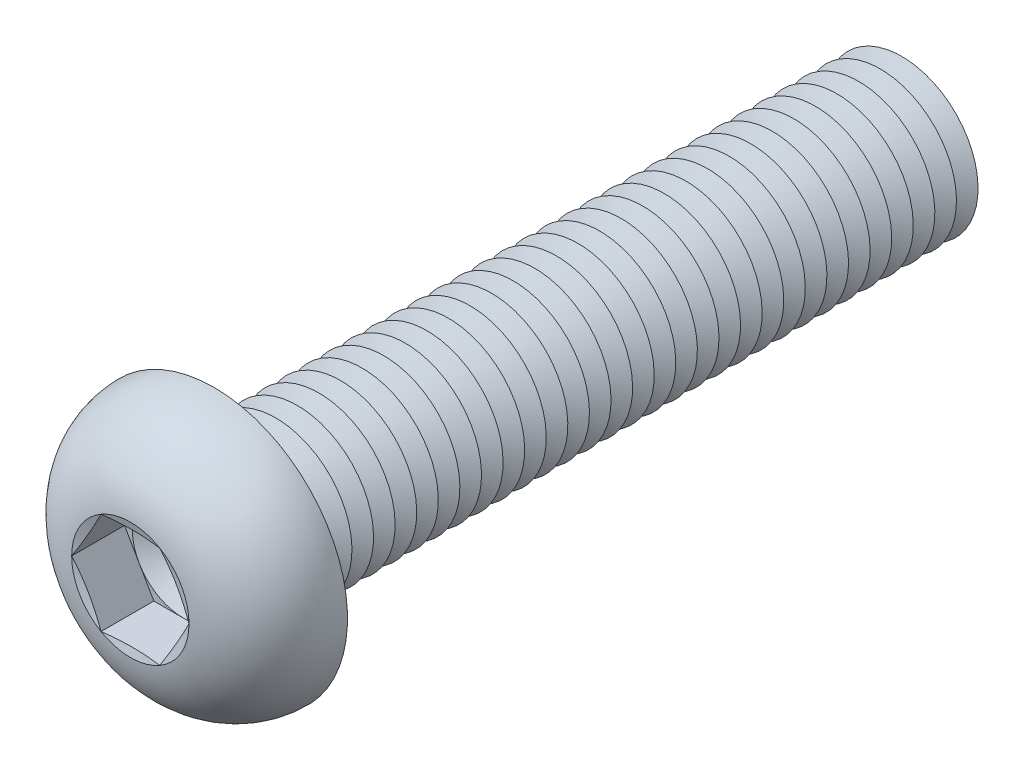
from build123d import *

# Parameters (mm, degrees)
FILLET1_R          = 0.85
LPATTERN1_COUNT    = 32
LPATTERN1_PITCH    = 1.7
CUT_EXTRUDE1_DEPTH = 4.16


with BuildPart() as part:
    # Sketch1 → Revolve1 (revolve)
    with BuildSketch(Plane(origin=(0, 0, 0), x_dir=(0, 0, -1), z_dir=(1, 0, 0))):
        with BuildLine():
            Line((0, 6), (0, 10.5))
            ThreePointArc((0, 10.5), (-4.420082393, 8.816378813), (-6.6, 4.6188))
            Line((-6.6, 4.6188), (-5.981198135, 2.3094))
            Line((-5.981198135, 2.3094), (-6.6, 2.3094))
            Line((-6.6, 2.3094), (-6.6, 0))
            Line((-6.6, 0), (55, 0))
            Line((55, 0), (55, 6))
            Line((55, 6), (0, 6))
        make_face()
    revolve(axis=Axis((0, 0, -55), (0, 0, 1)))

    # Fillet1
    fillet1_edges = [part.edges().sort_by_distance(p)[0] for p in [
        (0, -6, 0),
    ]]
    fillet(fillet1_edges, radius=FILLET1_R)

    # Sketch2 → Cut-Revolve1 (revolve, cut)
    with BuildSketch(Plane(origin=(0, 0, 0), x_dir=(0, 0, -1), z_dir=(1, 0, 0))):
        Polygon((54.15, 6), (55.85, 6), (55, 4.527756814), align=None)
    cut_revolve1 = revolve(axis=Axis((0, 0, -55), (0, 0, -1)), mode=Mode.SUBTRACT)

    # LPattern1: Cut-Revolve1 ×32
    with Locations(*[(0, 0, i * LPATTERN1_PITCH) for i in range(1, LPATTERN1_COUNT)]):
        add(cut_revolve1, mode=Mode.SUBTRACT)

    # Sketch3 → Cut-Extrude1 (cut)
    with BuildSketch(Plane.XY.offset(6.6)):
        Polygon((2.3094, 3.999998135), (-2.3094, 3.999998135), (-4.6188, 0), (-2.3094, -3.999998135), (2.3094, -3.999998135), (4.6188, 0), align=None)
    extrude(amount=-CUT_EXTRUDE1_DEPTH, mode=Mode.SUBTRACT)

    # Cut-Extrude2 cone 1 section (on through the dimple's axis) → Cut-Extrude2 (revolve, cut)
    with BuildSketch(Plane(origin=(0, 0, 2.44), x_dir=(0, -1, 0), z_dir=(1, 0, 0))):
        Polygon((0, 0), (3.999998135, 0), (0, 2.3094), align=None)
    revolve(axis=Axis((0, 0, 2.44), (0, 0, -1)), mode=Mode.SUBTRACT)


solid = part.part
